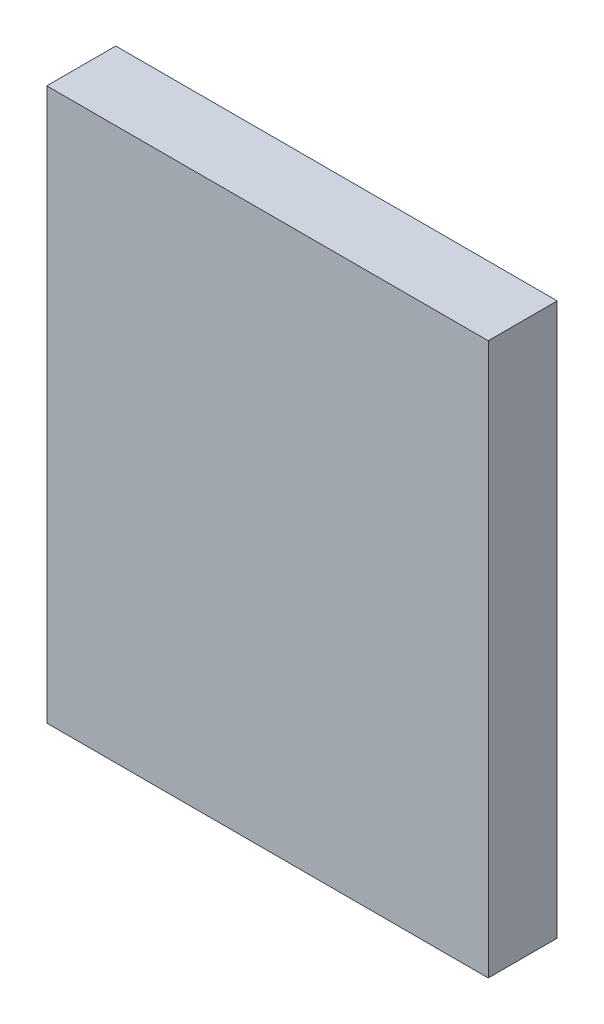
from build123d import *

# Parameters (mm, degrees)
SKETCH1_W      = 80
SKETCH1_H      = 100
EXTRUDE1_DEPTH = 12.5


with BuildPart() as part:
    # Sketch1 → Extrude1 (new body)
    with BuildSketch(Plane.XY):
        with Locations((40, 50)):
            Rectangle(SKETCH1_W, SKETCH1_H)
    extrude(amount=EXTRUDE1_DEPTH)


solid = part.part
